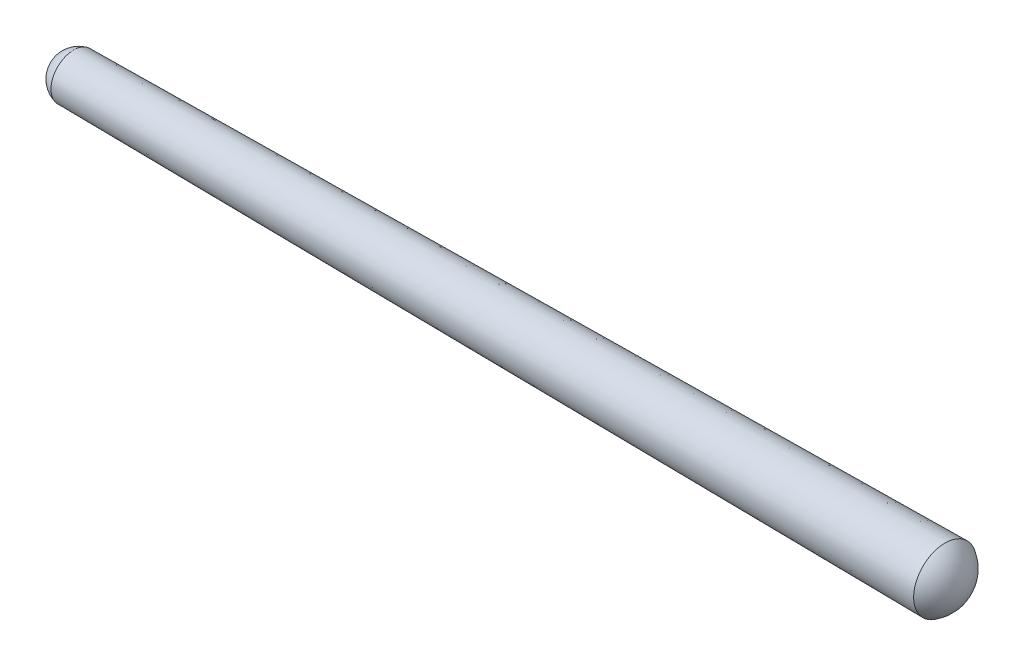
ISO-10303-21;
HEADER;
FILE_DESCRIPTION(('STEP AP214'),'2;1');
FILE_NAME('part.step','',(''),(''),'','','');
FILE_SCHEMA(('AUTOMOTIVE_DESIGN { 1 0 10303 214 1 1 1 1 }'));
ENDSEC;
DATA;
#1=APPLICATION_CONTEXT('core data for automotive mechanical design processes');
#2=APPLICATION_PROTOCOL_DEFINITION('international standard','automotive_design',2000,#1);
#3=PRODUCT_CONTEXT('',#1,'mechanical');
#4=PRODUCT('Part','Part','',(#3));
#5=PRODUCT_RELATED_PRODUCT_CATEGORY('part','',(#4));
#6=PRODUCT_DEFINITION_FORMATION('','',#4);
#7=PRODUCT_DEFINITION_CONTEXT('part definition',#1,'design');
#8=PRODUCT_DEFINITION('design','',#6,#7);
#9=PRODUCT_DEFINITION_SHAPE('','',#8);
#10=(LENGTH_UNIT() NAMED_UNIT(*) SI_UNIT(.MILLI.,.METRE.));
#11=(NAMED_UNIT(*) PLANE_ANGLE_UNIT() SI_UNIT($,.RADIAN.));
#12=(NAMED_UNIT(*) SI_UNIT($,.STERADIAN.) SOLID_ANGLE_UNIT());
#13=UNCERTAINTY_MEASURE_WITH_UNIT(LENGTH_MEASURE(1.E-05),#10,'distance_accuracy_value','');
#14=(GEOMETRIC_REPRESENTATION_CONTEXT(3) GLOBAL_UNCERTAINTY_ASSIGNED_CONTEXT((#13)) GLOBAL_UNIT_ASSIGNED_CONTEXT((#10,
#11,#12)) REPRESENTATION_CONTEXT('',''));
#15=CARTESIAN_POINT('',(0.,0.,0.));
#16=DIRECTION('',(0.,0.,1.));
#17=DIRECTION('',(1.,0.,0.));
#18=AXIS2_PLACEMENT_3D('',#15,#16,#17);
#19=CARTESIAN_POINT('',(38.4028400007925,0.,0.));
#20=DIRECTION('',(-1.,0.,0.));
#21=DIRECTION('',(0.,1.,0.));
#22=AXIS2_PLACEMENT_3D('',#19,#20,#21);
#23=SPHERICAL_SURFACE('',#22,1.59715999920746);
#24=CARTESIAN_POINT('',(39.2,0.,0.));
#25=DIRECTION('',(-1.,0.,0.));
#26=DIRECTION('',(0.,0.,1.));
#27=AXIS2_PLACEMENT_3D('',#24,#25,#26);
#28=CIRCLE('',#27,1.3839999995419);
#29=CARTESIAN_POINT('',(39.2,0.,1.3839999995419));
#30=VERTEX_POINT('',#29);
#31=EDGE_CURVE('E35',#30,#30,#28,.T.);
#32=ORIENTED_EDGE('',*,*,#31,.F.);
#33=EDGE_LOOP('',(#32));
#34=FACE_BOUND('',#33,.T.);
#35=ADVANCED_FACE('F29',(#34),#23,.T.);
#36=CARTESIAN_POINT('',(1.025,0.,0.));
#37=DIRECTION('',(-1.,0.,0.));
#38=DIRECTION('',(0.,1.,0.));
#39=AXIS2_PLACEMENT_3D('',#36,#37,#38);
#40=SPHERICAL_SURFACE('',#39,1.025);
#41=CARTESIAN_POINT('',(0.8,0.,0.));
#42=DIRECTION('',(-1.,0.,0.));
#43=DIRECTION('',(0.,0.,1.));
#44=AXIS2_PLACEMENT_3D('',#41,#42,#43);
#45=CIRCLE('',#44,1.);
#46=CARTESIAN_POINT('',(0.8,0.,1.));
#47=VERTEX_POINT('',#46);
#48=EDGE_CURVE('E10',#47,#47,#45,.T.);
#49=ORIENTED_EDGE('',*,*,#48,.T.);
#50=EDGE_LOOP('',(#49));
#51=FACE_BOUND('',#50,.T.);
#52=ADVANCED_FACE('F44',(#51),#40,.T.);
#53=CARTESIAN_POINT('',(39.2,0.,0.));
#54=DIRECTION('',(1.,0.,0.));
#55=DIRECTION('',(0.,0.,-1.));
#56=AXIS2_PLACEMENT_3D('',#53,#54,#55);
#57=CONICAL_SURFACE('',#56,1.3839999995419,0.00999966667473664);
#58=ORIENTED_EDGE('',*,*,#48,.F.);
#59=EDGE_LOOP('',(#58));
#60=FACE_BOUND('',#59,.T.);
#61=ORIENTED_EDGE('',*,*,#31,.T.);
#62=EDGE_LOOP('',(#61));
#63=FACE_BOUND('',#62,.T.);
#64=ADVANCED_FACE('F41',(#60,#63),#57,.T.);
#65=CLOSED_SHELL('',(#35,#52,#64));
#66=MANIFOLD_SOLID_BREP('B2',#65);
#67=ADVANCED_BREP_SHAPE_REPRESENTATION('',(#18,#66),#14);
#68=SHAPE_DEFINITION_REPRESENTATION(#9,#67);
ENDSEC;
END-ISO-10303-21;
